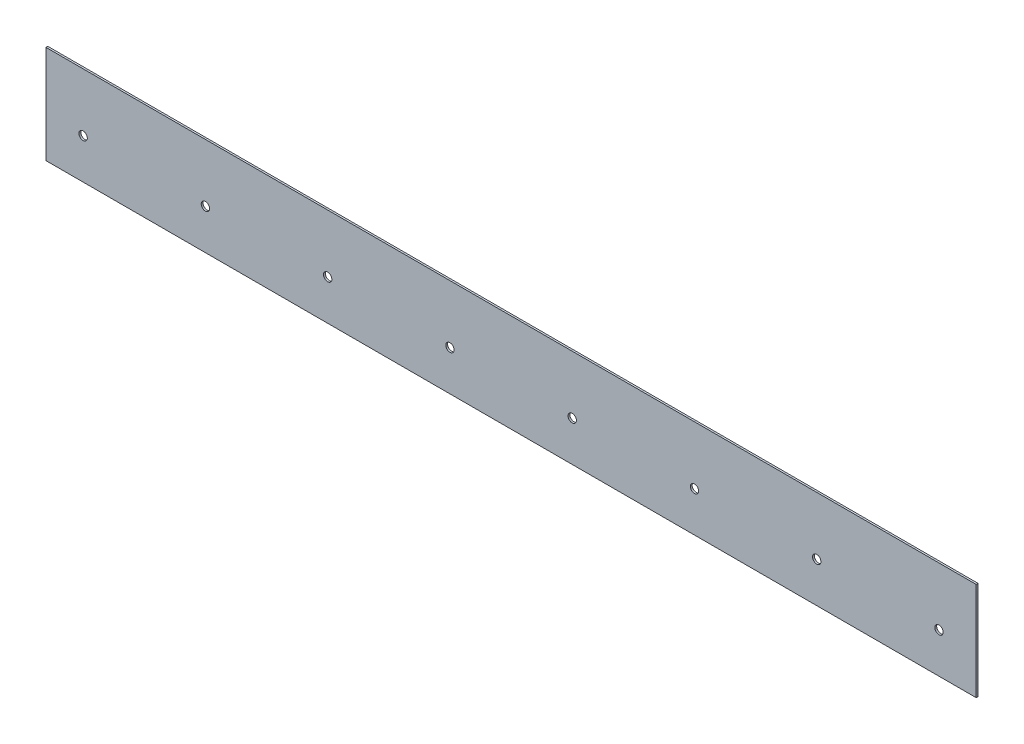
ISO-10303-21;
HEADER;
FILE_DESCRIPTION(('STEP AP214'),'2;1');
FILE_NAME('part.step','',(''),(''),'','','');
FILE_SCHEMA(('AUTOMOTIVE_DESIGN { 1 0 10303 214 1 1 1 1 }'));
ENDSEC;
DATA;
#1=APPLICATION_CONTEXT('core data for automotive mechanical design processes');
#2=APPLICATION_PROTOCOL_DEFINITION('international standard','automotive_design',2000,#1);
#3=PRODUCT_CONTEXT('',#1,'mechanical');
#4=PRODUCT('Part','Part','',(#3));
#5=PRODUCT_RELATED_PRODUCT_CATEGORY('part','',(#4));
#6=PRODUCT_DEFINITION_FORMATION('','',#4);
#7=PRODUCT_DEFINITION_CONTEXT('part definition',#1,'design');
#8=PRODUCT_DEFINITION('design','',#6,#7);
#9=PRODUCT_DEFINITION_SHAPE('','',#8);
#10=(LENGTH_UNIT() NAMED_UNIT(*) SI_UNIT(.MILLI.,.METRE.));
#11=(NAMED_UNIT(*) PLANE_ANGLE_UNIT() SI_UNIT($,.RADIAN.));
#12=(NAMED_UNIT(*) SI_UNIT($,.STERADIAN.) SOLID_ANGLE_UNIT());
#13=UNCERTAINTY_MEASURE_WITH_UNIT(LENGTH_MEASURE(1.E-05),#10,'distance_accuracy_value','');
#14=(GEOMETRIC_REPRESENTATION_CONTEXT(3) GLOBAL_UNCERTAINTY_ASSIGNED_CONTEXT((#13)) GLOBAL_UNIT_ASSIGNED_CONTEXT((#10,
#11,#12)) REPRESENTATION_CONTEXT('',''));
#15=CARTESIAN_POINT('',(0.,0.,0.));
#16=DIRECTION('',(0.,0.,1.));
#17=DIRECTION('',(1.,0.,0.));
#18=AXIS2_PLACEMENT_3D('',#15,#16,#17);
#19=CARTESIAN_POINT('',(0.,0.,10.));
#20=DIRECTION('',(1.,0.,0.));
#21=DIRECTION('',(0.,0.,-1.));
#22=AXIS2_PLACEMENT_3D('',#19,#20,#21);
#23=PLANE('',#22);
#24=DIRECTION('',(0.,-1.,0.));
#25=VECTOR('',#24,1.);
#26=CARTESIAN_POINT('',(0.,0.,0.));
#27=LINE('',#26,#25);
#28=CARTESIAN_POINT('',(0.,528.535100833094,0.));
#29=VERTEX_POINT('',#28);
#30=CARTESIAN_POINT('',(0.,0.,0.));
#31=VERTEX_POINT('',#30);
#32=EDGE_CURVE('E94',#29,#31,#27,.T.);
#33=ORIENTED_EDGE('',*,*,#32,.T.);
#34=DIRECTION('',(0.,0.,-1.));
#35=VECTOR('',#34,1.);
#36=CARTESIAN_POINT('',(0.,0.,10.));
#37=LINE('',#36,#35);
#38=CARTESIAN_POINT('',(0.,0.,10.));
#39=VERTEX_POINT('',#38);
#40=EDGE_CURVE('E11',#39,#31,#37,.T.);
#41=ORIENTED_EDGE('',*,*,#40,.F.);
#42=DIRECTION('',(0.,-1.,0.));
#43=VECTOR('',#42,1.);
#44=CARTESIAN_POINT('',(0.,0.,10.));
#45=LINE('',#44,#43);
#46=CARTESIAN_POINT('',(0.,528.535100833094,10.));
#47=VERTEX_POINT('',#46);
#48=EDGE_CURVE('E82',#47,#39,#45,.T.);
#49=ORIENTED_EDGE('',*,*,#48,.F.);
#50=DIRECTION('',(0.,0.,-1.));
#51=VECTOR('',#50,1.);
#52=CARTESIAN_POINT('',(0.,528.535100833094,10.));
#53=LINE('',#52,#51);
#54=EDGE_CURVE('E90',#47,#29,#53,.T.);
#55=ORIENTED_EDGE('',*,*,#54,.T.);
#56=EDGE_LOOP('',(#33,#41,#49,#55));
#57=FACE_BOUND('',#56,.T.);
#58=ADVANCED_FACE('F31',(#57),#23,.F.);
#59=CARTESIAN_POINT('',(0.,0.,10.));
#60=DIRECTION('',(0.,1.,0.));
#61=DIRECTION('',(0.,0.,1.));
#62=AXIS2_PLACEMENT_3D('',#59,#60,#61);
#63=PLANE('',#62);
#64=DIRECTION('',(1.,0.,0.));
#65=VECTOR('',#64,1.);
#66=CARTESIAN_POINT('',(0.,0.,0.));
#67=LINE('',#66,#65);
#68=CARTESIAN_POINT('',(5010.63352419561,0.,0.));
#69=VERTEX_POINT('',#68);
#70=EDGE_CURVE('E86',#31,#69,#67,.T.);
#71=ORIENTED_EDGE('',*,*,#70,.T.);
#72=DIRECTION('',(0.,0.,-1.));
#73=VECTOR('',#72,1.);
#74=CARTESIAN_POINT('',(5010.63352419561,0.,10.));
#75=LINE('',#74,#73);
#76=CARTESIAN_POINT('',(5010.63352419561,0.,10.));
#77=VERTEX_POINT('',#76);
#78=EDGE_CURVE('E39',#77,#69,#75,.T.);
#79=ORIENTED_EDGE('',*,*,#78,.F.);
#80=DIRECTION('',(1.,0.,0.));
#81=VECTOR('',#80,1.);
#82=CARTESIAN_POINT('',(0.,0.,10.));
#83=LINE('',#82,#81);
#84=EDGE_CURVE('E77',#39,#77,#83,.T.);
#85=ORIENTED_EDGE('',*,*,#84,.F.);
#86=ORIENTED_EDGE('',*,*,#40,.T.);
#87=EDGE_LOOP('',(#71,#79,#85,#86));
#88=FACE_BOUND('',#87,.T.);
#89=ADVANCED_FACE('F85',(#88),#63,.F.);
#90=CARTESIAN_POINT('',(5010.63352419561,0.,10.));
#91=DIRECTION('',(-1.,0.,0.));
#92=DIRECTION('',(0.,0.,1.));
#93=AXIS2_PLACEMENT_3D('',#90,#91,#92);
#94=PLANE('',#93);
#95=DIRECTION('',(0.,1.,0.));
#96=VECTOR('',#95,1.);
#97=CARTESIAN_POINT('',(5010.63352419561,0.,0.));
#98=LINE('',#97,#96);
#99=CARTESIAN_POINT('',(5010.63352419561,528.535100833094,0.));
#100=VERTEX_POINT('',#99);
#101=EDGE_CURVE('E64',#69,#100,#98,.T.);
#102=ORIENTED_EDGE('',*,*,#101,.T.);
#103=DIRECTION('',(0.,0.,-1.));
#104=VECTOR('',#103,1.);
#105=CARTESIAN_POINT('',(5010.63352419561,528.535100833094,10.));
#106=LINE('',#105,#104);
#107=CARTESIAN_POINT('',(5010.63352419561,528.535100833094,10.));
#108=VERTEX_POINT('',#107);
#109=EDGE_CURVE('E87',#108,#100,#106,.T.);
#110=ORIENTED_EDGE('',*,*,#109,.F.);
#111=DIRECTION('',(0.,1.,0.));
#112=VECTOR('',#111,1.);
#113=CARTESIAN_POINT('',(5010.63352419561,0.,10.));
#114=LINE('',#113,#112);
#115=EDGE_CURVE('E80',#77,#108,#114,.T.);
#116=ORIENTED_EDGE('',*,*,#115,.F.);
#117=ORIENTED_EDGE('',*,*,#78,.T.);
#118=EDGE_LOOP('',(#102,#110,#116,#117));
#119=FACE_BOUND('',#118,.T.);
#120=ADVANCED_FACE('F88',(#119),#94,.F.);
#121=CARTESIAN_POINT('',(0.,528.535100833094,10.));
#122=DIRECTION('',(0.,-1.,0.));
#123=DIRECTION('',(0.,0.,-1.));
#124=AXIS2_PLACEMENT_3D('',#121,#122,#123);
#125=PLANE('',#124);
#126=DIRECTION('',(-1.,0.,0.));
#127=VECTOR('',#126,1.);
#128=CARTESIAN_POINT('',(0.,528.535100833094,0.));
#129=LINE('',#128,#127);
#130=EDGE_CURVE('E70',#100,#29,#129,.T.);
#131=ORIENTED_EDGE('',*,*,#130,.T.);
#132=ORIENTED_EDGE('',*,*,#54,.F.);
#133=DIRECTION('',(-1.,0.,0.));
#134=VECTOR('',#133,1.);
#135=CARTESIAN_POINT('',(0.,528.535100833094,10.));
#136=LINE('',#135,#134);
#137=EDGE_CURVE('E47',#108,#47,#136,.T.);
#138=ORIENTED_EDGE('',*,*,#137,.F.);
#139=ORIENTED_EDGE('',*,*,#109,.T.);
#140=EDGE_LOOP('',(#131,#132,#138,#139));
#141=FACE_BOUND('',#140,.T.);
#142=ADVANCED_FACE('F102',(#141),#125,.F.);
#143=CARTESIAN_POINT('',(0.,528.535100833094,10.));
#144=DIRECTION('',(0.,0.,-1.));
#145=DIRECTION('',(-1.,0.,0.));
#146=AXIS2_PLACEMENT_3D('',#143,#144,#145);
#147=PLANE('',#146);
#148=CARTESIAN_POINT('',(4810.63352419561,216.299758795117,10.));
#149=DIRECTION('',(0.,0.,1.));
#150=DIRECTION('',(1.,0.,0.));
#151=AXIS2_PLACEMENT_3D('',#148,#149,#150);
#152=CIRCLE('',#151,22.5);
#153=CARTESIAN_POINT('',(4833.13352419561,216.299758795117,10.));
#154=VERTEX_POINT('',#153);
#155=EDGE_CURVE('E149',#154,#154,#152,.T.);
#156=ORIENTED_EDGE('',*,*,#155,.F.);
#157=EDGE_LOOP('',(#156));
#158=FACE_BOUND('',#157,.T.);
#159=CARTESIAN_POINT('',(4151.97159216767,216.299758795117,10.));
#160=DIRECTION('',(0.,0.,1.));
#161=DIRECTION('',(1.,0.,0.));
#162=AXIS2_PLACEMENT_3D('',#159,#160,#161);
#163=CIRCLE('',#162,22.5);
#164=CARTESIAN_POINT('',(4174.47159216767,216.299758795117,10.));
#165=VERTEX_POINT('',#164);
#166=EDGE_CURVE('E143',#165,#165,#163,.T.);
#167=ORIENTED_EDGE('',*,*,#166,.F.);
#168=EDGE_LOOP('',(#167));
#169=FACE_BOUND('',#168,.T.);
#170=CARTESIAN_POINT('',(3493.30966013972,216.299758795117,10.));
#171=DIRECTION('',(0.,0.,1.));
#172=DIRECTION('',(1.,0.,0.));
#173=AXIS2_PLACEMENT_3D('',#170,#171,#172);
#174=CIRCLE('',#173,22.5);
#175=CARTESIAN_POINT('',(3515.80966013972,216.299758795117,10.));
#176=VERTEX_POINT('',#175);
#177=EDGE_CURVE('E137',#176,#176,#174,.T.);
#178=ORIENTED_EDGE('',*,*,#177,.F.);
#179=EDGE_LOOP('',(#178));
#180=FACE_BOUND('',#179,.T.);
#181=CARTESIAN_POINT('',(2834.64772811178,216.299758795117,10.));
#182=DIRECTION('',(0.,0.,1.));
#183=DIRECTION('',(1.,0.,0.));
#184=AXIS2_PLACEMENT_3D('',#181,#182,#183);
#185=CIRCLE('',#184,22.5);
#186=CARTESIAN_POINT('',(2857.14772811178,216.299758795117,10.));
#187=VERTEX_POINT('',#186);
#188=EDGE_CURVE('E131',#187,#187,#185,.T.);
#189=ORIENTED_EDGE('',*,*,#188,.F.);
#190=EDGE_LOOP('',(#189));
#191=FACE_BOUND('',#190,.T.);
#192=CARTESIAN_POINT('',(2175.98579608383,216.299758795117,10.));
#193=DIRECTION('',(0.,0.,1.));
#194=DIRECTION('',(1.,0.,0.));
#195=AXIS2_PLACEMENT_3D('',#192,#193,#194);
#196=CIRCLE('',#195,22.5);
#197=CARTESIAN_POINT('',(2198.48579608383,216.299758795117,10.));
#198=VERTEX_POINT('',#197);
#199=EDGE_CURVE('E125',#198,#198,#196,.T.);
#200=ORIENTED_EDGE('',*,*,#199,.F.);
#201=EDGE_LOOP('',(#200));
#202=FACE_BOUND('',#201,.T.);
#203=CARTESIAN_POINT('',(1517.32386405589,216.299758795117,10.));
#204=DIRECTION('',(0.,0.,1.));
#205=DIRECTION('',(1.,0.,0.));
#206=AXIS2_PLACEMENT_3D('',#203,#204,#205);
#207=CIRCLE('',#206,22.5);
#208=CARTESIAN_POINT('',(1539.82386405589,216.299758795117,10.));
#209=VERTEX_POINT('',#208);
#210=EDGE_CURVE('E119',#209,#209,#207,.T.);
#211=ORIENTED_EDGE('',*,*,#210,.F.);
#212=EDGE_LOOP('',(#211));
#213=FACE_BOUND('',#212,.T.);
#214=CARTESIAN_POINT('',(858.661932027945,216.299758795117,10.));
#215=DIRECTION('',(0.,0.,1.));
#216=DIRECTION('',(1.,0.,0.));
#217=AXIS2_PLACEMENT_3D('',#214,#215,#216);
#218=CIRCLE('',#217,22.5);
#219=CARTESIAN_POINT('',(881.161932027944,216.299758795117,10.));
#220=VERTEX_POINT('',#219);
#221=EDGE_CURVE('E113',#220,#220,#218,.T.);
#222=ORIENTED_EDGE('',*,*,#221,.F.);
#223=EDGE_LOOP('',(#222));
#224=FACE_BOUND('',#223,.T.);
#225=CARTESIAN_POINT('',(200.,216.299758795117,10.));
#226=DIRECTION('',(0.,0.,1.));
#227=DIRECTION('',(1.,0.,0.));
#228=AXIS2_PLACEMENT_3D('',#225,#226,#227);
#229=CIRCLE('',#228,22.5);
#230=CARTESIAN_POINT('',(222.5,216.299758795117,10.));
#231=VERTEX_POINT('',#230);
#232=EDGE_CURVE('E110',#231,#231,#229,.T.);
#233=ORIENTED_EDGE('',*,*,#232,.F.);
#234=EDGE_LOOP('',(#233));
#235=FACE_BOUND('',#234,.T.);
#236=ORIENTED_EDGE('',*,*,#48,.T.);
#237=ORIENTED_EDGE('',*,*,#84,.T.);
#238=ORIENTED_EDGE('',*,*,#115,.T.);
#239=ORIENTED_EDGE('',*,*,#137,.T.);
#240=EDGE_LOOP('',(#236,#237,#238,#239));
#241=FACE_BOUND('',#240,.T.);
#242=ADVANCED_FACE('F78',(#158,#169,#180,#191,#202,#213,#224,#235,#241),#147,.F.);
#243=CARTESIAN_POINT('',(0.,528.535100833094,0.));
#244=DIRECTION('',(0.,0.,-1.));
#245=DIRECTION('',(-1.,0.,0.));
#246=AXIS2_PLACEMENT_3D('',#243,#244,#245);
#247=PLANE('',#246);
#248=CARTESIAN_POINT('',(4810.63352419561,216.299758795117,0.));
#249=DIRECTION('',(0.,0.,1.));
#250=DIRECTION('',(1.,0.,0.));
#251=AXIS2_PLACEMENT_3D('',#248,#249,#250);
#252=CIRCLE('',#251,22.5);
#253=CARTESIAN_POINT('',(4833.13352419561,216.299758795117,0.));
#254=VERTEX_POINT('',#253);
#255=EDGE_CURVE('E152',#254,#254,#252,.T.);
#256=ORIENTED_EDGE('',*,*,#255,.T.);
#257=EDGE_LOOP('',(#256));
#258=FACE_BOUND('',#257,.T.);
#259=CARTESIAN_POINT('',(4151.97159216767,216.299758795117,0.));
#260=DIRECTION('',(0.,0.,1.));
#261=DIRECTION('',(1.,0.,0.));
#262=AXIS2_PLACEMENT_3D('',#259,#260,#261);
#263=CIRCLE('',#262,22.5);
#264=CARTESIAN_POINT('',(4174.47159216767,216.299758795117,0.));
#265=VERTEX_POINT('',#264);
#266=EDGE_CURVE('E146',#265,#265,#263,.T.);
#267=ORIENTED_EDGE('',*,*,#266,.T.);
#268=EDGE_LOOP('',(#267));
#269=FACE_BOUND('',#268,.T.);
#270=CARTESIAN_POINT('',(3493.30966013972,216.299758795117,0.));
#271=DIRECTION('',(0.,0.,1.));
#272=DIRECTION('',(1.,0.,0.));
#273=AXIS2_PLACEMENT_3D('',#270,#271,#272);
#274=CIRCLE('',#273,22.5);
#275=CARTESIAN_POINT('',(3515.80966013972,216.299758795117,0.));
#276=VERTEX_POINT('',#275);
#277=EDGE_CURVE('E140',#276,#276,#274,.T.);
#278=ORIENTED_EDGE('',*,*,#277,.T.);
#279=EDGE_LOOP('',(#278));
#280=FACE_BOUND('',#279,.T.);
#281=CARTESIAN_POINT('',(2834.64772811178,216.299758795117,0.));
#282=DIRECTION('',(0.,0.,1.));
#283=DIRECTION('',(1.,0.,0.));
#284=AXIS2_PLACEMENT_3D('',#281,#282,#283);
#285=CIRCLE('',#284,22.5);
#286=CARTESIAN_POINT('',(2857.14772811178,216.299758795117,0.));
#287=VERTEX_POINT('',#286);
#288=EDGE_CURVE('E134',#287,#287,#285,.T.);
#289=ORIENTED_EDGE('',*,*,#288,.T.);
#290=EDGE_LOOP('',(#289));
#291=FACE_BOUND('',#290,.T.);
#292=CARTESIAN_POINT('',(2175.98579608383,216.299758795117,0.));
#293=DIRECTION('',(0.,0.,1.));
#294=DIRECTION('',(1.,0.,0.));
#295=AXIS2_PLACEMENT_3D('',#292,#293,#294);
#296=CIRCLE('',#295,22.5);
#297=CARTESIAN_POINT('',(2198.48579608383,216.299758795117,0.));
#298=VERTEX_POINT('',#297);
#299=EDGE_CURVE('E128',#298,#298,#296,.T.);
#300=ORIENTED_EDGE('',*,*,#299,.T.);
#301=EDGE_LOOP('',(#300));
#302=FACE_BOUND('',#301,.T.);
#303=CARTESIAN_POINT('',(1517.32386405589,216.299758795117,0.));
#304=DIRECTION('',(0.,0.,1.));
#305=DIRECTION('',(1.,0.,0.));
#306=AXIS2_PLACEMENT_3D('',#303,#304,#305);
#307=CIRCLE('',#306,22.5);
#308=CARTESIAN_POINT('',(1539.82386405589,216.299758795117,0.));
#309=VERTEX_POINT('',#308);
#310=EDGE_CURVE('E122',#309,#309,#307,.T.);
#311=ORIENTED_EDGE('',*,*,#310,.T.);
#312=EDGE_LOOP('',(#311));
#313=FACE_BOUND('',#312,.T.);
#314=CARTESIAN_POINT('',(858.661932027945,216.299758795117,0.));
#315=DIRECTION('',(0.,0.,1.));
#316=DIRECTION('',(1.,0.,0.));
#317=AXIS2_PLACEMENT_3D('',#314,#315,#316);
#318=CIRCLE('',#317,22.5);
#319=CARTESIAN_POINT('',(881.161932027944,216.299758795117,0.));
#320=VERTEX_POINT('',#319);
#321=EDGE_CURVE('E116',#320,#320,#318,.T.);
#322=ORIENTED_EDGE('',*,*,#321,.T.);
#323=EDGE_LOOP('',(#322));
#324=FACE_BOUND('',#323,.T.);
#325=CARTESIAN_POINT('',(200.,216.299758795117,0.));
#326=DIRECTION('',(0.,0.,1.));
#327=DIRECTION('',(1.,0.,0.));
#328=AXIS2_PLACEMENT_3D('',#325,#326,#327);
#329=CIRCLE('',#328,22.5);
#330=CARTESIAN_POINT('',(222.5,216.299758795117,0.));
#331=VERTEX_POINT('',#330);
#332=EDGE_CURVE('E97',#331,#331,#329,.T.);
#333=ORIENTED_EDGE('',*,*,#332,.T.);
#334=EDGE_LOOP('',(#333));
#335=FACE_BOUND('',#334,.T.);
#336=ORIENTED_EDGE('',*,*,#32,.F.);
#337=ORIENTED_EDGE('',*,*,#130,.F.);
#338=ORIENTED_EDGE('',*,*,#101,.F.);
#339=ORIENTED_EDGE('',*,*,#70,.F.);
#340=EDGE_LOOP('',(#336,#337,#338,#339));
#341=FACE_BOUND('',#340,.T.);
#342=ADVANCED_FACE('F105',(#258,#269,#280,#291,#302,#313,#324,#335,#341),#247,.T.);
#343=CARTESIAN_POINT('',(200.,216.299758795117,10.));
#344=DIRECTION('',(0.,0.,1.));
#345=DIRECTION('',(1.,0.,0.));
#346=AXIS2_PLACEMENT_3D('',#343,#344,#345);
#347=CYLINDRICAL_SURFACE('',#346,22.5);
#348=ORIENTED_EDGE('',*,*,#332,.F.);
#349=EDGE_LOOP('',(#348));
#350=FACE_BOUND('',#349,.T.);
#351=ORIENTED_EDGE('',*,*,#232,.T.);
#352=EDGE_LOOP('',(#351));
#353=FACE_BOUND('',#352,.T.);
#354=ADVANCED_FACE('F182',(#350,#353),#347,.F.);
#355=CARTESIAN_POINT('',(858.661932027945,216.299758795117,10.));
#356=DIRECTION('',(0.,0.,1.));
#357=DIRECTION('',(1.,0.,0.));
#358=AXIS2_PLACEMENT_3D('',#355,#356,#357);
#359=CYLINDRICAL_SURFACE('',#358,22.5);
#360=ORIENTED_EDGE('',*,*,#321,.F.);
#361=EDGE_LOOP('',(#360));
#362=FACE_BOUND('',#361,.T.);
#363=ORIENTED_EDGE('',*,*,#221,.T.);
#364=EDGE_LOOP('',(#363));
#365=FACE_BOUND('',#364,.T.);
#366=ADVANCED_FACE('F184',(#362,#365),#359,.F.);
#367=CARTESIAN_POINT('',(1517.32386405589,216.299758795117,10.));
#368=DIRECTION('',(0.,0.,1.));
#369=DIRECTION('',(1.,0.,0.));
#370=AXIS2_PLACEMENT_3D('',#367,#368,#369);
#371=CYLINDRICAL_SURFACE('',#370,22.5);
#372=ORIENTED_EDGE('',*,*,#310,.F.);
#373=EDGE_LOOP('',(#372));
#374=FACE_BOUND('',#373,.T.);
#375=ORIENTED_EDGE('',*,*,#210,.T.);
#376=EDGE_LOOP('',(#375));
#377=FACE_BOUND('',#376,.T.);
#378=ADVANCED_FACE('F191',(#374,#377),#371,.F.);
#379=CARTESIAN_POINT('',(2175.98579608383,216.299758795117,10.));
#380=DIRECTION('',(0.,0.,1.));
#381=DIRECTION('',(1.,0.,0.));
#382=AXIS2_PLACEMENT_3D('',#379,#380,#381);
#383=CYLINDRICAL_SURFACE('',#382,22.5);
#384=ORIENTED_EDGE('',*,*,#299,.F.);
#385=EDGE_LOOP('',(#384));
#386=FACE_BOUND('',#385,.T.);
#387=ORIENTED_EDGE('',*,*,#199,.T.);
#388=EDGE_LOOP('',(#387));
#389=FACE_BOUND('',#388,.T.);
#390=ADVANCED_FACE('F234',(#386,#389),#383,.F.);
#391=CARTESIAN_POINT('',(2834.64772811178,216.299758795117,10.));
#392=DIRECTION('',(0.,0.,1.));
#393=DIRECTION('',(1.,0.,0.));
#394=AXIS2_PLACEMENT_3D('',#391,#392,#393);
#395=CYLINDRICAL_SURFACE('',#394,22.5);
#396=ORIENTED_EDGE('',*,*,#288,.F.);
#397=EDGE_LOOP('',(#396));
#398=FACE_BOUND('',#397,.T.);
#399=ORIENTED_EDGE('',*,*,#188,.T.);
#400=EDGE_LOOP('',(#399));
#401=FACE_BOUND('',#400,.T.);
#402=ADVANCED_FACE('F244',(#398,#401),#395,.F.);
#403=CARTESIAN_POINT('',(3493.30966013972,216.299758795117,10.));
#404=DIRECTION('',(0.,0.,1.));
#405=DIRECTION('',(1.,0.,0.));
#406=AXIS2_PLACEMENT_3D('',#403,#404,#405);
#407=CYLINDRICAL_SURFACE('',#406,22.5);
#408=ORIENTED_EDGE('',*,*,#277,.F.);
#409=EDGE_LOOP('',(#408));
#410=FACE_BOUND('',#409,.T.);
#411=ORIENTED_EDGE('',*,*,#177,.T.);
#412=EDGE_LOOP('',(#411));
#413=FACE_BOUND('',#412,.T.);
#414=ADVANCED_FACE('F254',(#410,#413),#407,.F.);
#415=CARTESIAN_POINT('',(4151.97159216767,216.299758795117,10.));
#416=DIRECTION('',(0.,0.,1.));
#417=DIRECTION('',(1.,0.,0.));
#418=AXIS2_PLACEMENT_3D('',#415,#416,#417);
#419=CYLINDRICAL_SURFACE('',#418,22.5);
#420=ORIENTED_EDGE('',*,*,#266,.F.);
#421=EDGE_LOOP('',(#420));
#422=FACE_BOUND('',#421,.T.);
#423=ORIENTED_EDGE('',*,*,#166,.T.);
#424=EDGE_LOOP('',(#423));
#425=FACE_BOUND('',#424,.T.);
#426=ADVANCED_FACE('F161',(#422,#425),#419,.F.);
#427=CARTESIAN_POINT('',(4810.63352419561,216.299758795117,10.));
#428=DIRECTION('',(0.,0.,1.));
#429=DIRECTION('',(1.,0.,0.));
#430=AXIS2_PLACEMENT_3D('',#427,#428,#429);
#431=CYLINDRICAL_SURFACE('',#430,22.5);
#432=ORIENTED_EDGE('',*,*,#255,.F.);
#433=EDGE_LOOP('',(#432));
#434=FACE_BOUND('',#433,.T.);
#435=ORIENTED_EDGE('',*,*,#155,.T.);
#436=EDGE_LOOP('',(#435));
#437=FACE_BOUND('',#436,.T.);
#438=ADVANCED_FACE('F158',(#434,#437),#431,.F.);
#439=CLOSED_SHELL('',(#58,#89,#120,#142,#242,#342,#354,#366,#378,#390,#402,#414,#426,#438));
#440=MANIFOLD_SOLID_BREP('B2',#439);
#441=ADVANCED_BREP_SHAPE_REPRESENTATION('',(#18,#440),#14);
#442=SHAPE_DEFINITION_REPRESENTATION(#9,#441);
ENDSEC;
END-ISO-10303-21;
